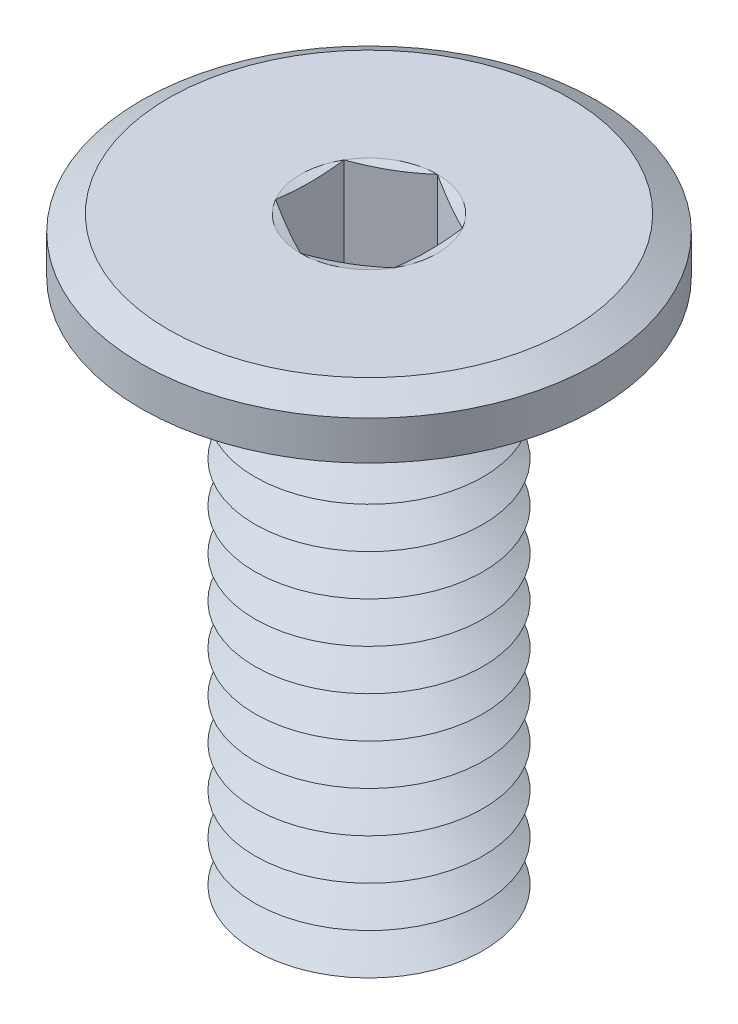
from build123d import *

# Parameters (mm, degrees)
SKETCH1_R           = 2.5
BOSS_EXTRUDE1_DEPTH = 0.6
SKETCH2_R           = 1.25
BOSS_EXTRUDE2_DEPTH = 6
LPATTERN1_COUNT     = 12
LPATTERN1_PITCH     = 0.45
FILLET1_R           = 0.1
CHAMFER2_SIZE       = 0.3
CHAMFER2_SIZE2      = 0.173205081
CUT_EXTRUDE1_DEPTH  = 1.2


with BuildPart() as part:
    # Sketch1 → Boss-Extrude1 (new body)
    with BuildSketch(Plane(origin=(0, 0, 0), x_dir=(1, 0, 0), z_dir=(0, 1, 0))):
        with Locations(Location((0, 0, 0), (0, 0, 270))):
            Circle(SKETCH1_R)
    extrude(amount=-BOSS_EXTRUDE1_DEPTH)

    # Sketch2 → Boss-Extrude2 (add)
    with BuildSketch(Plane.XZ.offset(0.6)):
        with Locations(Location((0, 0, 0), (0, 0, 270))):
            Circle(SKETCH2_R)
    extrude(amount=BOSS_EXTRUDE2_DEPTH)

    # Sketch5 → Cut-Revolve1 (revolve, cut)
    with BuildSketch(Plane(origin=(0, 0, 0), x_dir=(0, 0, -1), z_dir=(1, 0, 0))):
        Polygon((-1.25, -6.825), (-0.860288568, -6.6), (-1.25, -6.375), align=None)
    cut_revolve1 = revolve(axis=Axis((0, 0.990593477, 0), (0, -1, 0)), mode=Mode.SUBTRACT)

    # LPattern1: Cut-Revolve1 ×12
    with Locations(*[(0, i * LPATTERN1_PITCH, 0) for i in range(1, LPATTERN1_COUNT)]):
        add(cut_revolve1, mode=Mode.SUBTRACT)

    # Fillet1
    fillet1_edges = [part.edges().sort_by_distance(p)[0] for p in [
        (0, -0.6, 1.25),
    ]]
    fillet(fillet1_edges, radius=FILLET1_R)

    # Chamfer2
    chamfer2_edges = [part.edges().sort_by_distance(p)[0] for p in [
        (0, 0, -2.5),
    ]]
    chamfer2_side = [part.faces().sort_by_distance(p)[0] for p in [
        (0, 0, 0),
    ]]
    chamfer(chamfer2_edges, length=CHAMFER2_SIZE, length2=CHAMFER2_SIZE2, reference=chamfer2_side[0])

    # Sketch6 → Cut-Extrude1 (cut)
    with BuildSketch(Plane(origin=(0, 0, 0), x_dir=(1, 0, 0), z_dir=(0, 1, 0))):
        Polygon((0, 0.75055535), (-0.65, 0.375277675), (-0.65, -0.375277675), (0, -0.75055535), (0.65, -0.375277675), (0.65, 0.375277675), align=None)
    extrude(amount=-CUT_EXTRUDE1_DEPTH, mode=Mode.SUBTRACT)

    # Cut-Extrude2 cone 1 section (on through the dimple's axis) → Cut-Extrude2 (revolve, cut)
    with BuildSketch(Plane(origin=(0, -1.2, 0), x_dir=(0, 0, 1), z_dir=(1, 0, 0))):
        Polygon((0, 0), (0.65, 0), (0, 0.375277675), align=None)
    revolve(axis=Axis((0, -1.2, 0), (0, -1, 0)), mode=Mode.SUBTRACT)

    # Cut-Extrude3 cone 1 section (on through the dimple's axis) → Cut-Extrude3 (revolve, cut)
    with BuildSketch(Plane(origin=(0, 0, 0), x_dir=(0, 0, 1), z_dir=(1, 0, 0))):
        Polygon((0, 0), (0.75055535, 0), (0, 0.2011107), align=None)
    revolve(axis=Axis((0, 0, 0), (0, -1, 0)), mode=Mode.SUBTRACT)


solid = part.part
